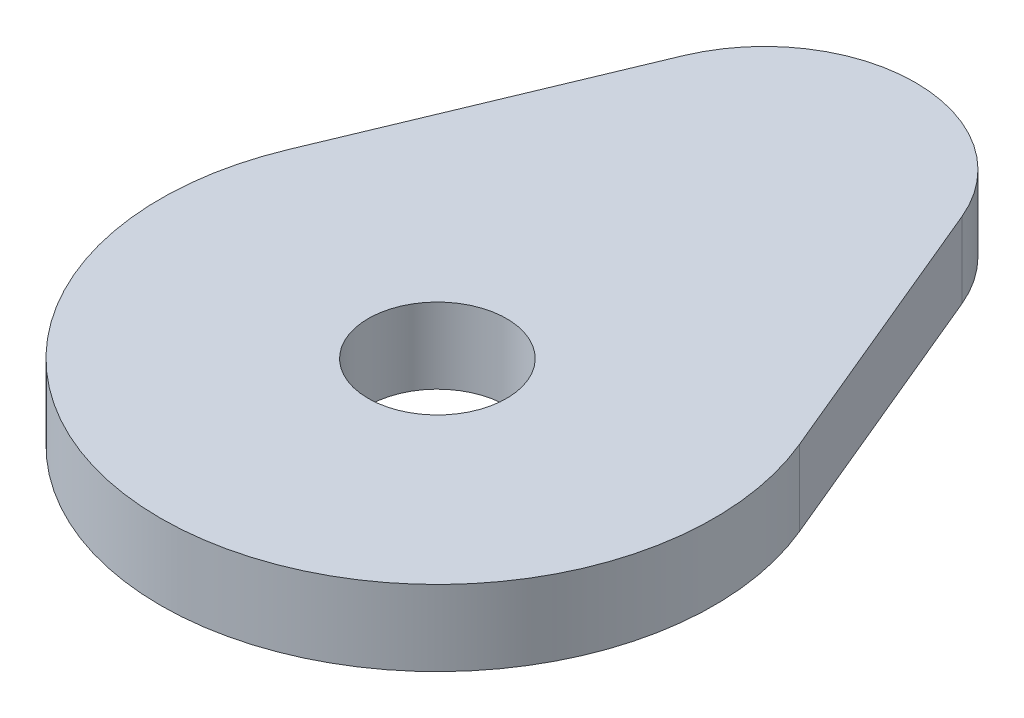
from build123d import *

# Parameters (mm, degrees)
SKETCH1_R      = 2.75
EXTRUDE1_DEPTH = 3


with BuildPart() as part:
    # Sketch1 → Extrude1 (new body)
    with BuildSketch(Plane(origin=(0, 0, 0), x_dir=(1, 0, 0), z_dir=(0, 1, 0))):
        with BuildLine():
            Line((5.538461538, 15.307692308), (10.153846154, 4.230769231))
            ThreePointArc((10.153846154, 4.230769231), (0, -11), (-10.153846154, 4.230769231))
            Line((-10.153846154, 4.230769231), (-5.538461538, 15.307692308))
            ThreePointArc((-5.538461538, 15.307692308), (0, 19), (5.538461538, 15.307692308))
        make_face()
        with Locations(Location((0, 0, 0), (0, 0, 270))):
            Circle(SKETCH1_R, mode=Mode.SUBTRACT)
    extrude(amount=EXTRUDE1_DEPTH)


solid = part.part
